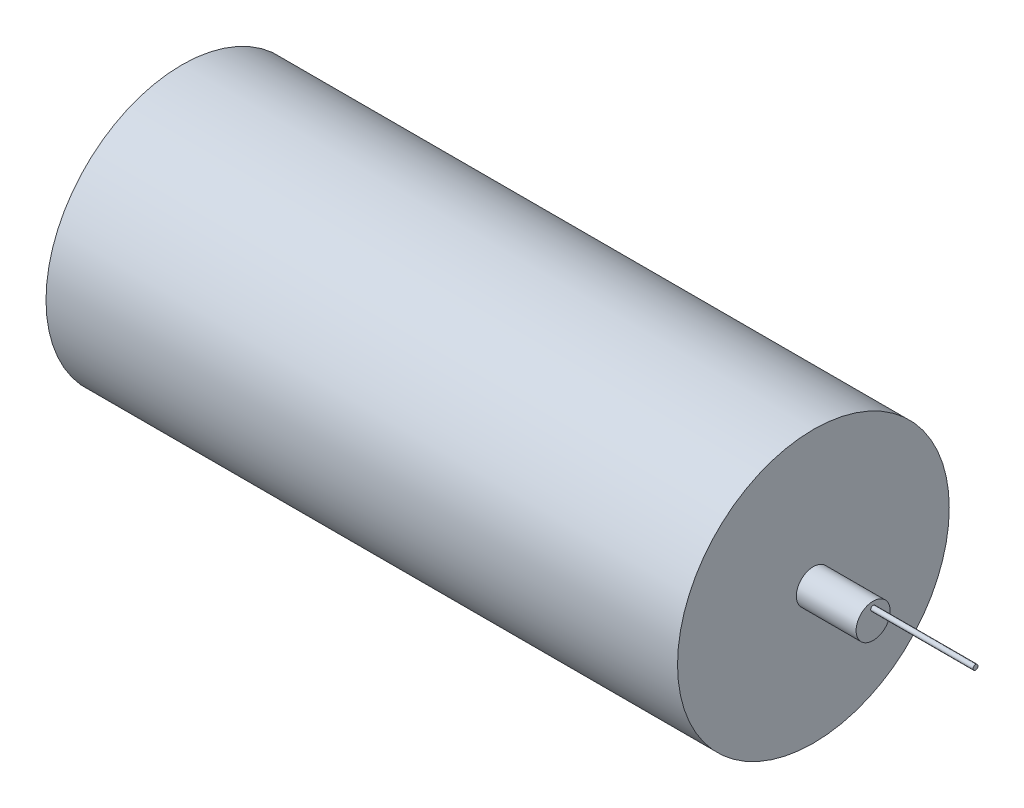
ISO-10303-21;
HEADER;
FILE_DESCRIPTION(('STEP AP214'),'2;1');
FILE_NAME('part.step','',(''),(''),'','','');
FILE_SCHEMA(('AUTOMOTIVE_DESIGN { 1 0 10303 214 1 1 1 1 }'));
ENDSEC;
DATA;
#1=APPLICATION_CONTEXT('core data for automotive mechanical design processes');
#2=APPLICATION_PROTOCOL_DEFINITION('international standard','automotive_design',2000,#1);
#3=PRODUCT_CONTEXT('',#1,'mechanical');
#4=PRODUCT('Part','Part','',(#3));
#5=PRODUCT_RELATED_PRODUCT_CATEGORY('part','',(#4));
#6=PRODUCT_DEFINITION_FORMATION('','',#4);
#7=PRODUCT_DEFINITION_CONTEXT('part definition',#1,'design');
#8=PRODUCT_DEFINITION('design','',#6,#7);
#9=PRODUCT_DEFINITION_SHAPE('','',#8);
#10=(LENGTH_UNIT() NAMED_UNIT(*) SI_UNIT(.MILLI.,.METRE.));
#11=(NAMED_UNIT(*) PLANE_ANGLE_UNIT() SI_UNIT($,.RADIAN.));
#12=(NAMED_UNIT(*) SI_UNIT($,.STERADIAN.) SOLID_ANGLE_UNIT());
#13=UNCERTAINTY_MEASURE_WITH_UNIT(LENGTH_MEASURE(1.E-05),#10,'distance_accuracy_value','');
#14=(GEOMETRIC_REPRESENTATION_CONTEXT(3) GLOBAL_UNCERTAINTY_ASSIGNED_CONTEXT((#13)) GLOBAL_UNIT_ASSIGNED_CONTEXT((#10,
#11,#12)) REPRESENTATION_CONTEXT('',''));
#15=CARTESIAN_POINT('',(0.,0.,0.));
#16=DIRECTION('',(0.,0.,1.));
#17=DIRECTION('',(1.,0.,0.));
#18=AXIS2_PLACEMENT_3D('',#15,#16,#17);
#19=CARTESIAN_POINT('',(462.5,0.,0.));
#20=DIRECTION('',(1.,0.,0.));
#21=DIRECTION('',(0.,0.,-1.));
#22=AXIS2_PLACEMENT_3D('',#19,#20,#21);
#23=PLANE('',#22);
#24=CARTESIAN_POINT('',(462.5,0.,0.));
#25=DIRECTION('',(1.,0.,0.));
#26=DIRECTION('',(0.,0.,-1.));
#27=AXIS2_PLACEMENT_3D('',#24,#25,#26);
#28=CIRCLE('',#27,199.);
#29=CARTESIAN_POINT('',(462.5,0.,199.));
#30=VERTEX_POINT('',#29);
#31=EDGE_CURVE('E10',#30,#30,#28,.T.);
#32=ORIENTED_EDGE('',*,*,#31,.T.);
#33=EDGE_LOOP('',(#32));
#34=FACE_BOUND('',#33,.T.);
#35=CARTESIAN_POINT('',(462.5,0.,0.));
#36=DIRECTION('',(1.,0.,0.));
#37=DIRECTION('',(0.,0.,-1.));
#38=AXIS2_PLACEMENT_3D('',#35,#36,#37);
#39=CIRCLE('',#38,25.);
#40=CARTESIAN_POINT('',(462.5,0.,-25.));
#41=VERTEX_POINT('',#40);
#42=EDGE_CURVE('E57',#41,#41,#39,.T.);
#43=ORIENTED_EDGE('',*,*,#42,.F.);
#44=EDGE_LOOP('',(#43));
#45=FACE_BOUND('',#44,.T.);
#46=ADVANCED_FACE('F38',(#34,#45),#23,.T.);
#47=CARTESIAN_POINT('',(-462.5,0.,0.));
#48=DIRECTION('',(1.,0.,0.));
#49=DIRECTION('',(0.,0.,-1.));
#50=AXIS2_PLACEMENT_3D('',#47,#48,#49);
#51=PLANE('',#50);
#52=CARTESIAN_POINT('',(-462.5,0.,0.));
#53=DIRECTION('',(1.,0.,0.));
#54=DIRECTION('',(0.,0.,-1.));
#55=AXIS2_PLACEMENT_3D('',#52,#53,#54);
#56=CIRCLE('',#55,199.);
#57=CARTESIAN_POINT('',(-462.5,0.,199.));
#58=VERTEX_POINT('',#57);
#59=EDGE_CURVE('E42',#58,#58,#56,.T.);
#60=ORIENTED_EDGE('',*,*,#59,.F.);
#61=EDGE_LOOP('',(#60));
#62=FACE_BOUND('',#61,.T.);
#63=CARTESIAN_POINT('',(-462.5,0.,0.));
#64=DIRECTION('',(1.,0.,0.));
#65=DIRECTION('',(0.,0.,-1.));
#66=AXIS2_PLACEMENT_3D('',#63,#64,#65);
#67=CIRCLE('',#66,25.);
#68=CARTESIAN_POINT('',(-462.5,0.,-25.));
#69=VERTEX_POINT('',#68);
#70=EDGE_CURVE('E69',#69,#69,#67,.F.);
#71=ORIENTED_EDGE('',*,*,#70,.F.);
#72=EDGE_LOOP('',(#71));
#73=FACE_BOUND('',#72,.T.);
#74=ADVANCED_FACE('F127',(#62,#73),#51,.F.);
#75=CARTESIAN_POINT('',(462.5,0.,0.));
#76=DIRECTION('',(-1.,0.,0.));
#77=DIRECTION('',(0.,0.,1.));
#78=AXIS2_PLACEMENT_3D('',#75,#76,#77);
#79=CYLINDRICAL_SURFACE('',#78,199.);
#80=CARTESIAN_POINT('',(462.5,0.,199.));
#81=CARTESIAN_POINT('',(452.864583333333,0.,199.));
#82=CARTESIAN_POINT('',(443.229166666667,0.,199.));
#83=CARTESIAN_POINT('',(423.958333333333,0.,199.));
#84=CARTESIAN_POINT('',(414.322916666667,0.,199.));
#85=CARTESIAN_POINT('',(395.052083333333,0.,199.));
#86=CARTESIAN_POINT('',(385.416666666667,0.,199.));
#87=CARTESIAN_POINT('',(366.145833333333,0.,199.));
#88=CARTESIAN_POINT('',(356.510416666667,0.,199.));
#89=CARTESIAN_POINT('',(337.239583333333,0.,199.));
#90=CARTESIAN_POINT('',(327.604166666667,0.,199.));
#91=CARTESIAN_POINT('',(308.333333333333,0.,199.));
#92=CARTESIAN_POINT('',(298.697916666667,0.,199.));
#93=CARTESIAN_POINT('',(279.427083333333,0.,199.));
#94=CARTESIAN_POINT('',(269.791666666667,0.,199.));
#95=CARTESIAN_POINT('',(250.520833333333,0.,199.));
#96=CARTESIAN_POINT('',(240.885416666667,0.,199.));
#97=CARTESIAN_POINT('',(221.614583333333,0.,199.));
#98=CARTESIAN_POINT('',(211.979166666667,0.,199.));
#99=CARTESIAN_POINT('',(192.708333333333,0.,199.));
#100=CARTESIAN_POINT('',(183.072916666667,0.,199.));
#101=CARTESIAN_POINT('',(163.802083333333,0.,199.));
#102=CARTESIAN_POINT('',(154.166666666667,0.,199.));
#103=CARTESIAN_POINT('',(134.895833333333,0.,199.));
#104=CARTESIAN_POINT('',(125.260416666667,0.,199.));
#105=CARTESIAN_POINT('',(105.989583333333,0.,199.));
#106=CARTESIAN_POINT('',(96.3541666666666,0.,199.));
#107=CARTESIAN_POINT('',(77.0833333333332,0.,199.));
#108=CARTESIAN_POINT('',(67.4479166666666,0.,199.));
#109=CARTESIAN_POINT('',(48.1770833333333,0.,199.));
#110=CARTESIAN_POINT('',(38.5416666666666,0.,199.));
#111=CARTESIAN_POINT('',(19.2708333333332,0.,199.));
#112=CARTESIAN_POINT('',(9.63541666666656,0.,199.));
#113=CARTESIAN_POINT('',(-9.63541666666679,0.,199.));
#114=CARTESIAN_POINT('',(-19.2708333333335,0.,199.));
#115=CARTESIAN_POINT('',(-38.5416666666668,0.,199.));
#116=CARTESIAN_POINT('',(-48.1770833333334,0.,199.));
#117=CARTESIAN_POINT('',(-67.4479166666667,0.,199.));
#118=CARTESIAN_POINT('',(-77.0833333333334,0.,199.));
#119=CARTESIAN_POINT('',(-96.3541666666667,0.,199.));
#120=CARTESIAN_POINT('',(-105.989583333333,0.,199.));
#121=CARTESIAN_POINT('',(-125.260416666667,0.,199.));
#122=CARTESIAN_POINT('',(-134.895833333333,0.,199.));
#123=CARTESIAN_POINT('',(-154.166666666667,0.,199.));
#124=CARTESIAN_POINT('',(-163.802083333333,0.,199.));
#125=CARTESIAN_POINT('',(-183.072916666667,0.,199.));
#126=CARTESIAN_POINT('',(-192.708333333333,0.,199.));
#127=CARTESIAN_POINT('',(-211.979166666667,0.,199.));
#128=CARTESIAN_POINT('',(-221.614583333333,0.,199.));
#129=CARTESIAN_POINT('',(-240.885416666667,0.,199.));
#130=CARTESIAN_POINT('',(-250.520833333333,0.,199.));
#131=CARTESIAN_POINT('',(-269.791666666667,0.,199.));
#132=CARTESIAN_POINT('',(-279.427083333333,0.,199.));
#133=CARTESIAN_POINT('',(-298.697916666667,0.,199.));
#134=CARTESIAN_POINT('',(-308.333333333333,0.,199.));
#135=CARTESIAN_POINT('',(-327.604166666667,0.,199.));
#136=CARTESIAN_POINT('',(-337.239583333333,0.,199.));
#137=CARTESIAN_POINT('',(-356.510416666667,0.,199.));
#138=CARTESIAN_POINT('',(-366.145833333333,0.,199.));
#139=CARTESIAN_POINT('',(-385.416666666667,0.,199.));
#140=CARTESIAN_POINT('',(-395.052083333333,0.,199.));
#141=CARTESIAN_POINT('',(-414.322916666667,0.,199.));
#142=CARTESIAN_POINT('',(-423.958333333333,0.,199.));
#143=CARTESIAN_POINT('',(-443.229166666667,0.,199.));
#144=CARTESIAN_POINT('',(-452.864583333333,0.,199.));
#145=CARTESIAN_POINT('',(-462.5,0.,199.));
#146=B_SPLINE_CURVE_WITH_KNOTS('',3,(#80,#81,#82,#83,#84,#85,#86,#87,#88,#89,#90,#91,#92,#93,
#94,#95,#96,#97,#98,#99,#100,#101,#102,#103,#104,#105,#106,#107,#108,#109,#110,#111,#112,#113,
#114,#115,#116,#117,#118,#119,#120,#121,#122,#123,#124,#125,#126,#127,#128,#129,#130,#131,#132,
#133,#134,#135,#136,#137,#138,#139,#140,#141,#142,#143,#144,#145),.UNSPECIFIED.,.F.,.F.,(4,2,2,
2,2,2,2,2,2,2,2,2,2,2,2,2,2,2,2,2,2,2,2,2,2,2,2,2,2,2,2,2,4),(0.,28.90625,57.8125,86.71875,
115.625,144.53125,173.4375,202.34375,231.25,260.15625,289.0625,317.96875,346.875,375.78125,
404.6875,433.59375,462.5,491.40625,520.3125,549.21875,578.125,607.03125,635.9375,664.84375,
693.75,722.65625,751.5625,780.46875,809.375,838.28125,867.1875,896.09375,925.),.UNSPECIFIED.);
#147=EDGE_CURVE('BSEAM40',#30,#58,#146,.T.);
#148=ORIENTED_EDGE('',*,*,#31,.F.);
#149=ORIENTED_EDGE('',*,*,#59,.T.);
#150=ORIENTED_EDGE('',*,*,#147,.T.);
#151=ORIENTED_EDGE('',*,*,#147,.F.);
#152=EDGE_LOOP('',(#148,#150,#149,#151));
#153=FACE_BOUND('',#152,.T.);
#154=ADVANCED_FACE('F40',(#153),#79,.T.);
#155=CARTESIAN_POINT('',(-550.,0.,0.));
#156=DIRECTION('',(1.,0.,0.));
#157=DIRECTION('',(0.,0.,-1.));
#158=AXIS2_PLACEMENT_3D('',#155,#156,#157);
#159=PLANE('',#158);
#160=CARTESIAN_POINT('',(-550.,0.,0.));
#161=DIRECTION('',(1.,0.,0.));
#162=DIRECTION('',(0.,0.,-1.));
#163=AXIS2_PLACEMENT_3D('',#160,#161,#162);
#164=CIRCLE('',#163,25.);
#165=CARTESIAN_POINT('',(-550.,0.,-25.));
#166=VERTEX_POINT('',#165);
#167=EDGE_CURVE('E78',#166,#166,#164,.T.);
#168=ORIENTED_EDGE('',*,*,#167,.F.);
#169=EDGE_LOOP('',(#168));
#170=FACE_BOUND('',#169,.T.);
#171=ADVANCED_FACE('F118',(#170),#159,.F.);
#172=CARTESIAN_POINT('',(550.,0.,0.));
#173=DIRECTION('',(-1.,0.,0.));
#174=DIRECTION('',(0.,0.,1.));
#175=AXIS2_PLACEMENT_3D('',#172,#173,#174);
#176=CYLINDRICAL_SURFACE('',#175,25.);
#177=ORIENTED_EDGE('',*,*,#167,.T.);
#178=EDGE_LOOP('',(#177));
#179=FACE_BOUND('',#178,.T.);
#180=ORIENTED_EDGE('',*,*,#70,.T.);
#181=EDGE_LOOP('',(#180));
#182=FACE_BOUND('',#181,.T.);
#183=ADVANCED_FACE('F110',(#179,#182),#176,.T.);
#184=ORIENTED_EDGE('',*,*,#42,.T.);
#185=EDGE_LOOP('',(#184));
#186=FACE_BOUND('',#185,.T.);
#187=CARTESIAN_POINT('',(550.,0.,0.));
#188=DIRECTION('',(1.,0.,0.));
#189=DIRECTION('',(0.,0.,-1.));
#190=AXIS2_PLACEMENT_3D('',#187,#188,#189);
#191=CIRCLE('',#190,25.);
#192=CARTESIAN_POINT('',(550.,0.,-25.));
#193=VERTEX_POINT('',#192);
#194=EDGE_CURVE('E77',#193,#193,#191,.T.);
#195=ORIENTED_EDGE('',*,*,#194,.F.);
#196=EDGE_LOOP('',(#195));
#197=FACE_BOUND('',#196,.T.);
#198=ADVANCED_FACE('F105',(#186,#197),#176,.T.);
#199=CARTESIAN_POINT('',(550.,0.,0.));
#200=DIRECTION('',(1.,0.,0.));
#201=DIRECTION('',(0.,0.,-1.));
#202=AXIS2_PLACEMENT_3D('',#199,#200,#201);
#203=PLANE('',#202);
#204=CARTESIAN_POINT('',(550.,15.957605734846,0.));
#205=DIRECTION('',(1.,0.,0.));
#206=DIRECTION('',(0.,0.,-1.));
#207=AXIS2_PLACEMENT_3D('',#204,#205,#206);
#208=CIRCLE('',#207,3.58834338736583);
#209=CARTESIAN_POINT('',(550.,15.957605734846,-3.58834338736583));
#210=VERTEX_POINT('',#209);
#211=EDGE_CURVE('E86',#210,#210,#208,.T.);
#212=ORIENTED_EDGE('',*,*,#211,.F.);
#213=EDGE_LOOP('',(#212));
#214=FACE_BOUND('',#213,.T.);
#215=ORIENTED_EDGE('',*,*,#194,.T.);
#216=EDGE_LOOP('',(#215));
#217=FACE_BOUND('',#216,.T.);
#218=ADVANCED_FACE('F99',(#214,#217),#203,.T.);
#219=CARTESIAN_POINT('',(700.,15.957605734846,0.));
#220=DIRECTION('',(-1.,0.,0.));
#221=DIRECTION('',(0.,0.,1.));
#222=AXIS2_PLACEMENT_3D('',#219,#220,#221);
#223=CYLINDRICAL_SURFACE('',#222,3.58834338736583);
#224=CARTESIAN_POINT('',(700.,15.957605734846,0.));
#225=DIRECTION('',(1.,0.,0.));
#226=DIRECTION('',(0.,0.,-1.));
#227=AXIS2_PLACEMENT_3D('',#224,#225,#226);
#228=CIRCLE('',#227,3.58834338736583);
#229=CARTESIAN_POINT('',(700.,15.957605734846,-3.58834338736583));
#230=VERTEX_POINT('',#229);
#231=EDGE_CURVE('E82',#230,#230,#228,.T.);
#232=ORIENTED_EDGE('',*,*,#231,.F.);
#233=EDGE_LOOP('',(#232));
#234=FACE_BOUND('',#233,.T.);
#235=ORIENTED_EDGE('',*,*,#211,.T.);
#236=EDGE_LOOP('',(#235));
#237=FACE_BOUND('',#236,.T.);
#238=ADVANCED_FACE('F96',(#234,#237),#223,.T.);
#239=CARTESIAN_POINT('',(700.,15.957605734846,0.));
#240=DIRECTION('',(1.,0.,0.));
#241=DIRECTION('',(0.,0.,-1.));
#242=AXIS2_PLACEMENT_3D('',#239,#240,#241);
#243=PLANE('',#242);
#244=ORIENTED_EDGE('',*,*,#231,.T.);
#245=EDGE_LOOP('',(#244));
#246=FACE_BOUND('',#245,.T.);
#247=ADVANCED_FACE('F94',(#246),#243,.T.);
#248=CLOSED_SHELL('',(#46,#74,#154,#171,#183,#198,#218,#238,#247));
#249=CARTESIAN_POINT('',(-457.5,0.,0.));
#250=DIRECTION('',(1.,0.,0.));
#251=DIRECTION('',(0.,0.,-1.));
#252=AXIS2_PLACEMENT_3D('',#249,#250,#251);
#253=CIRCLE('',#252,25.);
#254=CARTESIAN_POINT('',(-457.5,0.,-25.));
#255=VERTEX_POINT('',#254);
#256=EDGE_CURVE('E65',#255,#255,#253,.T.);
#257=ORIENTED_EDGE('',*,*,#256,.T.);
#258=EDGE_LOOP('',(#257));
#259=FACE_BOUND('',#258,.T.);
#260=CARTESIAN_POINT('',(457.5,0.,0.));
#261=DIRECTION('',(1.,0.,0.));
#262=DIRECTION('',(0.,0.,-1.));
#263=AXIS2_PLACEMENT_3D('',#260,#261,#262);
#264=CIRCLE('',#263,25.);
#265=CARTESIAN_POINT('',(457.5,0.,-25.));
#266=VERTEX_POINT('',#265);
#267=EDGE_CURVE('E73',#266,#266,#264,.F.);
#268=ORIENTED_EDGE('',*,*,#267,.T.);
#269=EDGE_LOOP('',(#268));
#270=FACE_BOUND('',#269,.T.);
#271=ADVANCED_FACE('F113',(#259,#270),#176,.T.);
#272=CARTESIAN_POINT('',(457.5,0.,0.));
#273=DIRECTION('',(1.,0.,0.));
#274=DIRECTION('',(0.,0.,-1.));
#275=AXIS2_PLACEMENT_3D('',#272,#273,#274);
#276=PLANE('',#275);
#277=ORIENTED_EDGE('',*,*,#267,.F.);
#278=EDGE_LOOP('',(#277));
#279=FACE_BOUND('',#278,.T.);
#280=CARTESIAN_POINT('',(457.5,0.,0.));
#281=DIRECTION('',(1.,0.,0.));
#282=DIRECTION('',(0.,0.,-1.));
#283=AXIS2_PLACEMENT_3D('',#280,#281,#282);
#284=CIRCLE('',#283,195.);
#285=CARTESIAN_POINT('',(457.5,0.,195.));
#286=VERTEX_POINT('',#285);
#287=EDGE_CURVE('E52',#286,#286,#284,.T.);
#288=ORIENTED_EDGE('',*,*,#287,.F.);
#289=EDGE_LOOP('',(#288));
#290=FACE_BOUND('',#289,.T.);
#291=ADVANCED_FACE('F123',(#279,#290),#276,.F.);
#292=CARTESIAN_POINT('',(462.5,0.,0.));
#293=DIRECTION('',(-1.,0.,0.));
#294=DIRECTION('',(0.,0.,1.));
#295=AXIS2_PLACEMENT_3D('',#292,#293,#294);
#296=CYLINDRICAL_SURFACE('',#295,195.);
#297=CARTESIAN_POINT('',(-457.5,0.,0.));
#298=DIRECTION('',(1.,0.,0.));
#299=DIRECTION('',(0.,0.,-1.));
#300=AXIS2_PLACEMENT_3D('',#297,#298,#299);
#301=CIRCLE('',#300,195.);
#302=CARTESIAN_POINT('',(-457.5,0.,195.));
#303=VERTEX_POINT('',#302);
#304=EDGE_CURVE('E61',#303,#303,#301,.T.);
#305=CARTESIAN_POINT('',(457.5,0.,195.));
#306=CARTESIAN_POINT('',(447.96875,0.,195.));
#307=CARTESIAN_POINT('',(438.4375,0.,195.));
#308=CARTESIAN_POINT('',(419.375,0.,195.));
#309=CARTESIAN_POINT('',(409.84375,0.,195.));
#310=CARTESIAN_POINT('',(390.78125,0.,195.));
#311=CARTESIAN_POINT('',(381.25,0.,195.));
#312=CARTESIAN_POINT('',(362.1875,0.,195.));
#313=CARTESIAN_POINT('',(352.65625,0.,195.));
#314=CARTESIAN_POINT('',(333.59375,0.,195.));
#315=CARTESIAN_POINT('',(324.0625,0.,195.));
#316=CARTESIAN_POINT('',(305.,0.,195.));
#317=CARTESIAN_POINT('',(295.46875,0.,195.));
#318=CARTESIAN_POINT('',(276.40625,0.,195.));
#319=CARTESIAN_POINT('',(266.875,0.,195.));
#320=CARTESIAN_POINT('',(247.8125,0.,195.));
#321=CARTESIAN_POINT('',(238.28125,0.,195.));
#322=CARTESIAN_POINT('',(219.21875,0.,195.));
#323=CARTESIAN_POINT('',(209.6875,0.,195.));
#324=CARTESIAN_POINT('',(190.625,0.,195.));
#325=CARTESIAN_POINT('',(181.09375,0.,195.));
#326=CARTESIAN_POINT('',(162.03125,0.,195.));
#327=CARTESIAN_POINT('',(152.5,0.,195.));
#328=CARTESIAN_POINT('',(133.4375,0.,195.));
#329=CARTESIAN_POINT('',(123.90625,0.,195.));
#330=CARTESIAN_POINT('',(104.84375,0.,195.));
#331=CARTESIAN_POINT('',(95.3125,0.,195.));
#332=CARTESIAN_POINT('',(76.25,0.,195.));
#333=CARTESIAN_POINT('',(66.71875,0.,195.));
#334=CARTESIAN_POINT('',(47.65625,0.,195.));
#335=CARTESIAN_POINT('',(38.125,0.,195.));
#336=CARTESIAN_POINT('',(19.0625,0.,195.));
#337=CARTESIAN_POINT('',(9.53124999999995,0.,195.));
#338=CARTESIAN_POINT('',(-9.53125000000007,0.,195.));
#339=CARTESIAN_POINT('',(-19.0625000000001,0.,195.));
#340=CARTESIAN_POINT('',(-38.125,0.,195.));
#341=CARTESIAN_POINT('',(-47.65625,0.,195.));
#342=CARTESIAN_POINT('',(-66.7187499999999,0.,195.));
#343=CARTESIAN_POINT('',(-76.2499999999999,0.,195.));
#344=CARTESIAN_POINT('',(-95.3125,0.,195.));
#345=CARTESIAN_POINT('',(-104.84375,0.,195.));
#346=CARTESIAN_POINT('',(-123.90625,0.,195.));
#347=CARTESIAN_POINT('',(-133.4375,0.,195.));
#348=CARTESIAN_POINT('',(-152.5,0.,195.));
#349=CARTESIAN_POINT('',(-162.03125,0.,195.));
#350=CARTESIAN_POINT('',(-181.09375,0.,195.));
#351=CARTESIAN_POINT('',(-190.625,0.,195.));
#352=CARTESIAN_POINT('',(-209.6875,0.,195.));
#353=CARTESIAN_POINT('',(-219.21875,0.,195.));
#354=CARTESIAN_POINT('',(-238.28125,0.,195.));
#355=CARTESIAN_POINT('',(-247.8125,0.,195.));
#356=CARTESIAN_POINT('',(-266.875,0.,195.));
#357=CARTESIAN_POINT('',(-276.40625,0.,195.));
#358=CARTESIAN_POINT('',(-295.46875,0.,195.));
#359=CARTESIAN_POINT('',(-305.,0.,195.));
#360=CARTESIAN_POINT('',(-324.0625,0.,195.));
#361=CARTESIAN_POINT('',(-333.59375,0.,195.));
#362=CARTESIAN_POINT('',(-352.65625,0.,195.));
#363=CARTESIAN_POINT('',(-362.1875,0.,195.));
#364=CARTESIAN_POINT('',(-381.25,0.,195.));
#365=CARTESIAN_POINT('',(-390.78125,0.,195.));
#366=CARTESIAN_POINT('',(-409.84375,0.,195.));
#367=CARTESIAN_POINT('',(-419.375,0.,195.));
#368=CARTESIAN_POINT('',(-438.4375,0.,195.));
#369=CARTESIAN_POINT('',(-447.96875,0.,195.));
#370=CARTESIAN_POINT('',(-457.5,0.,195.));
#371=B_SPLINE_CURVE_WITH_KNOTS('',3,(#305,#306,#307,#308,#309,#310,#311,#312,#313,#314,#315,
#316,#317,#318,#319,#320,#321,#322,#323,#324,#325,#326,#327,#328,#329,#330,#331,#332,#333,#334,
#335,#336,#337,#338,#339,#340,#341,#342,#343,#344,#345,#346,#347,#348,#349,#350,#351,#352,#353,
#354,#355,#356,#357,#358,#359,#360,#361,#362,#363,#364,#365,#366,#367,#368,#369,#370),
.UNSPECIFIED.,.F.,.F.,(4,2,2,2,2,2,2,2,2,2,2,2,2,2,2,2,2,2,2,2,2,2,2,2,2,2,2,2,2,2,2,2,4),(0.,
28.59375,57.1875,85.78125,114.375,142.96875,171.5625,200.15625,228.75,257.34375,285.9375,
314.53125,343.125,371.71875,400.3125,428.90625,457.5,486.09375,514.6875,543.28125,571.875,
600.46875,629.0625,657.65625,686.25,714.84375,743.4375,772.03125,800.625,829.21875,857.8125,
886.40625,915.),.UNSPECIFIED.);
#372=EDGE_CURVE('BSEAM135',#286,#303,#371,.T.);
#373=ORIENTED_EDGE('',*,*,#287,.T.);
#374=ORIENTED_EDGE('',*,*,#304,.F.);
#375=ORIENTED_EDGE('',*,*,#372,.T.);
#376=ORIENTED_EDGE('',*,*,#372,.F.);
#377=EDGE_LOOP('',(#373,#375,#374,#376));
#378=FACE_BOUND('',#377,.T.);
#379=ADVANCED_FACE('F135',(#378),#296,.F.);
#380=CARTESIAN_POINT('',(-457.5,0.,0.));
#381=DIRECTION('',(-1.,0.,0.));
#382=DIRECTION('',(0.,0.,-1.));
#383=AXIS2_PLACEMENT_3D('',#380,#381,#382);
#384=PLANE('',#383);
#385=ORIENTED_EDGE('',*,*,#304,.T.);
#386=EDGE_LOOP('',(#385));
#387=FACE_BOUND('',#386,.T.);
#388=ORIENTED_EDGE('',*,*,#256,.F.);
#389=EDGE_LOOP('',(#388));
#390=FACE_BOUND('',#389,.T.);
#391=ADVANCED_FACE('F138',(#387,#390),#384,.F.);
#392=CLOSED_SHELL('',(#271,#291,#379,#391));
#393=ORIENTED_CLOSED_SHELL('',*,#392,.T.);
#394=BREP_WITH_VOIDS('B2',#248,(#393));
#395=ADVANCED_BREP_SHAPE_REPRESENTATION('',(#18,#394),#14);
#396=SHAPE_DEFINITION_REPRESENTATION(#9,#395);
ENDSEC;
END-ISO-10303-21;
